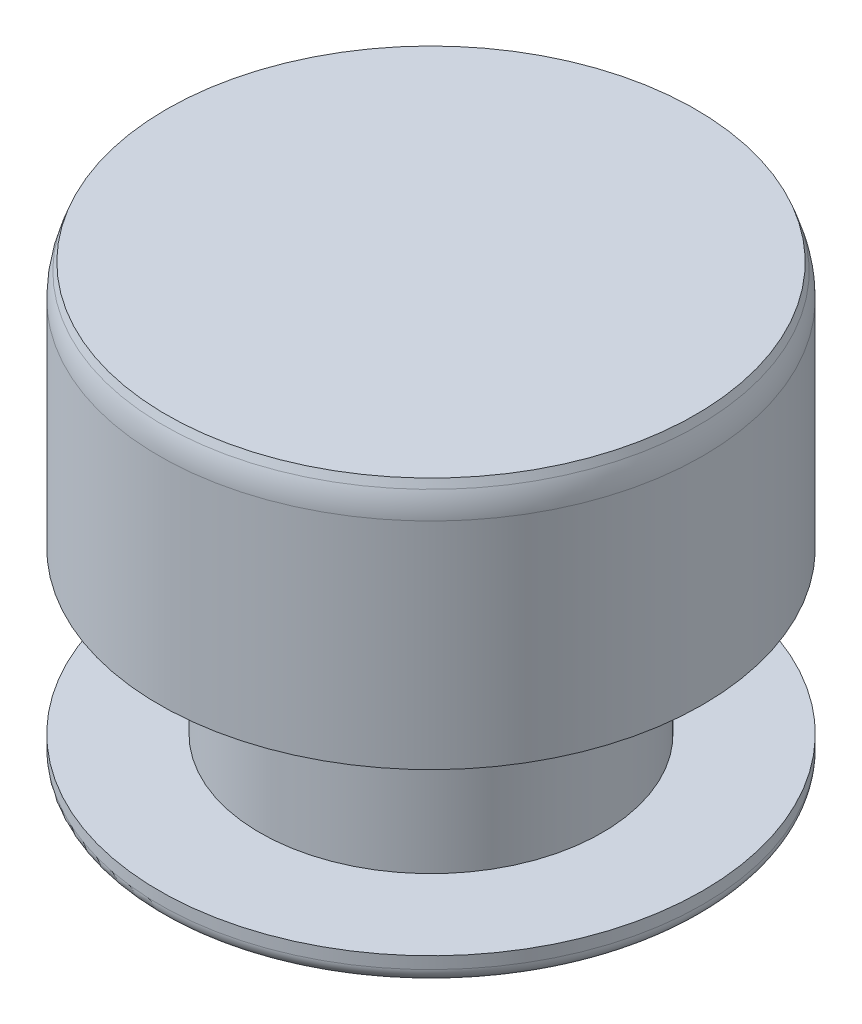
from build123d import *

# Parameters (mm, degrees)
FILLET1_R = 0.2
FILLET2_R = 1


with BuildPart() as part:
    # Sketch1 → Revolve1 (revolve)
    with BuildSketch(Plane.XY, mode=Mode.PRIVATE) as revolve1_sk:
        Polygon((0, 0), (0, -7.99956969), (0.5, -7.99956969), (3.81, -6.010721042), (3.81, -5.73), (2.4, -5.73), (2.4, -3.47), (3.81, -3.47), (3.81, -0.274747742), (3.71, 0), align=None)
    revolve(revolve1_sk.sketch.rotate(Axis((0, 0, 0), (0, -1, 0)), 180), axis=Axis((0, 0, 0), (0, -1, 0)))

    # Fillet1
    fillet1_edges = [part.edges().sort_by_distance(p)[0] for p in [
        (3.81, -6.010721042, 0),
    ]]
    fillet(fillet1_edges, radius=FILLET1_R)

    # Fillet2
    fillet2_edges = [part.edges().sort_by_distance(p)[0] for p in [
        (3.81, -0.274747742, 0),
    ]]
    fillet(fillet2_edges, radius=FILLET2_R)


solid = part.part
